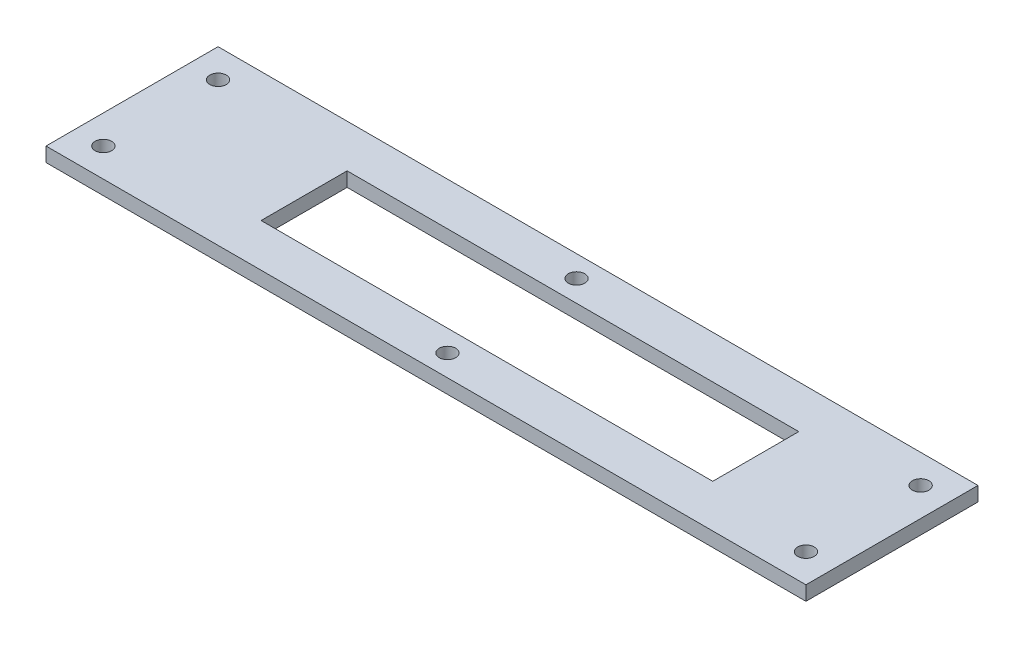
ISO-10303-21;
HEADER;
FILE_DESCRIPTION(('STEP AP214'),'2;1');
FILE_NAME('part.step','',(''),(''),'','','');
FILE_SCHEMA(('AUTOMOTIVE_DESIGN { 1 0 10303 214 1 1 1 1 }'));
ENDSEC;
DATA;
#1=APPLICATION_CONTEXT('core data for automotive mechanical design processes');
#2=APPLICATION_PROTOCOL_DEFINITION('international standard','automotive_design',2000,#1);
#3=PRODUCT_CONTEXT('',#1,'mechanical');
#4=PRODUCT('Part','Part','',(#3));
#5=PRODUCT_RELATED_PRODUCT_CATEGORY('part','',(#4));
#6=PRODUCT_DEFINITION_FORMATION('','',#4);
#7=PRODUCT_DEFINITION_CONTEXT('part definition',#1,'design');
#8=PRODUCT_DEFINITION('design','',#6,#7);
#9=PRODUCT_DEFINITION_SHAPE('','',#8);
#10=(LENGTH_UNIT() NAMED_UNIT(*) SI_UNIT(.MILLI.,.METRE.));
#11=(NAMED_UNIT(*) PLANE_ANGLE_UNIT() SI_UNIT($,.RADIAN.));
#12=(NAMED_UNIT(*) SI_UNIT($,.STERADIAN.) SOLID_ANGLE_UNIT());
#13=UNCERTAINTY_MEASURE_WITH_UNIT(LENGTH_MEASURE(1.E-05),#10,'distance_accuracy_value','');
#14=(GEOMETRIC_REPRESENTATION_CONTEXT(3) GLOBAL_UNCERTAINTY_ASSIGNED_CONTEXT((#13)) GLOBAL_UNIT_ASSIGNED_CONTEXT((#10,
#11,#12)) REPRESENTATION_CONTEXT('',''));
#15=CARTESIAN_POINT('',(0.,0.,0.));
#16=DIRECTION('',(0.,0.,1.));
#17=DIRECTION('',(1.,0.,0.));
#18=AXIS2_PLACEMENT_3D('',#15,#16,#17);
#19=CARTESIAN_POINT('',(0.,2.,0.));
#20=DIRECTION('',(0.,1.,0.));
#21=DIRECTION('',(0.,0.,1.));
#22=AXIS2_PLACEMENT_3D('',#19,#20,#21);
#23=PLANE('',#22);
#24=CARTESIAN_POINT('',(-0.5,2.,9.00000000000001));
#25=DIRECTION('',(0.,1.,0.));
#26=DIRECTION('',(0.,0.,1.));
#27=AXIS2_PLACEMENT_3D('',#24,#25,#26);
#28=CIRCLE('',#27,1.15);
#29=CARTESIAN_POINT('',(-0.5,2.,10.15));
#30=VERTEX_POINT('',#29);
#31=EDGE_CURVE('E254',#30,#30,#28,.T.);
#32=ORIENTED_EDGE('',*,*,#31,.F.);
#33=EDGE_LOOP('',(#32));
#34=FACE_BOUND('',#33,.T.);
#35=CARTESIAN_POINT('',(48.5,2.,8.));
#36=DIRECTION('',(0.,1.,0.));
#37=DIRECTION('',(0.,0.,1.));
#38=AXIS2_PLACEMENT_3D('',#35,#36,#37);
#39=CIRCLE('',#38,1.15);
#40=CARTESIAN_POINT('',(48.5,2.,9.15));
#41=VERTEX_POINT('',#40);
#42=EDGE_CURVE('E266',#41,#41,#39,.T.);
#43=ORIENTED_EDGE('',*,*,#42,.F.);
#44=EDGE_LOOP('',(#43));
#45=FACE_BOUND('',#44,.T.);
#46=CARTESIAN_POINT('',(-49.5,2.,-7.99999999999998));
#47=DIRECTION('',(0.,1.,0.));
#48=DIRECTION('',(0.,0.,1.));
#49=AXIS2_PLACEMENT_3D('',#46,#47,#48);
#50=CIRCLE('',#49,1.15);
#51=CARTESIAN_POINT('',(-49.5,2.,-6.84999999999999));
#52=VERTEX_POINT('',#51);
#53=EDGE_CURVE('E127',#52,#52,#50,.T.);
#54=ORIENTED_EDGE('',*,*,#53,.F.);
#55=EDGE_LOOP('',(#54));
#56=FACE_BOUND('',#55,.T.);
#57=DIRECTION('',(-1.,0.,0.));
#58=VECTOR('',#57,1.);
#59=CARTESIAN_POINT('',(52.5,2.,-12.));
#60=LINE('',#59,#58);
#61=CARTESIAN_POINT('',(52.5,2.,-12.));
#62=VERTEX_POINT('',#61);
#63=CARTESIAN_POINT('',(-53.5,2.,-12.));
#64=VERTEX_POINT('',#63);
#65=EDGE_CURVE('E137',#62,#64,#60,.T.);
#66=ORIENTED_EDGE('',*,*,#65,.T.);
#67=DIRECTION('',(0.,0.,1.));
#68=VECTOR('',#67,1.);
#69=CARTESIAN_POINT('',(-53.5,2.,-12.));
#70=LINE('',#69,#68);
#71=CARTESIAN_POINT('',(-53.5,2.,12.));
#72=VERTEX_POINT('',#71);
#73=EDGE_CURVE('E140',#64,#72,#70,.T.);
#74=ORIENTED_EDGE('',*,*,#73,.T.);
#75=DIRECTION('',(1.,0.,0.));
#76=VECTOR('',#75,1.);
#77=CARTESIAN_POINT('',(52.5,2.,12.));
#78=LINE('',#77,#76);
#79=CARTESIAN_POINT('',(52.5,2.,12.));
#80=VERTEX_POINT('',#79);
#81=EDGE_CURVE('E143',#72,#80,#78,.T.);
#82=ORIENTED_EDGE('',*,*,#81,.T.);
#83=DIRECTION('',(0.,0.,-1.));
#84=VECTOR('',#83,1.);
#85=CARTESIAN_POINT('',(52.5,2.,12.));
#86=LINE('',#85,#84);
#87=EDGE_CURVE('E145',#80,#62,#86,.T.);
#88=ORIENTED_EDGE('',*,*,#87,.T.);
#89=EDGE_LOOP('',(#66,#74,#82,#88));
#90=FACE_BOUND('',#89,.T.);
#91=DIRECTION('',(1.,0.,0.));
#92=VECTOR('',#91,1.);
#93=CARTESIAN_POINT('',(-29.5,2.,6.));
#94=LINE('',#93,#92);
#95=CARTESIAN_POINT('',(-29.5,2.,6.));
#96=VERTEX_POINT('',#95);
#97=CARTESIAN_POINT('',(33.5,2.,6.));
#98=VERTEX_POINT('',#97);
#99=EDGE_CURVE('E106',#96,#98,#94,.T.);
#100=ORIENTED_EDGE('',*,*,#99,.F.);
#101=DIRECTION('',(0.,0.,1.));
#102=VECTOR('',#101,1.);
#103=CARTESIAN_POINT('',(-29.5,2.,-6.));
#104=LINE('',#103,#102);
#105=CARTESIAN_POINT('',(-29.5,2.,-6.));
#106=VERTEX_POINT('',#105);
#107=EDGE_CURVE('E98',#106,#96,#104,.T.);
#108=ORIENTED_EDGE('',*,*,#107,.F.);
#109=DIRECTION('',(-1.,0.,0.));
#110=VECTOR('',#109,1.);
#111=CARTESIAN_POINT('',(-29.5,2.,-6.));
#112=LINE('',#111,#110);
#113=CARTESIAN_POINT('',(33.5,2.,-6.));
#114=VERTEX_POINT('',#113);
#115=EDGE_CURVE('E121',#114,#106,#112,.T.);
#116=ORIENTED_EDGE('',*,*,#115,.F.);
#117=DIRECTION('',(0.,0.,-1.));
#118=VECTOR('',#117,1.);
#119=CARTESIAN_POINT('',(33.5,2.,-6.));
#120=LINE('',#119,#118);
#121=EDGE_CURVE('E119',#98,#114,#120,.T.);
#122=ORIENTED_EDGE('',*,*,#121,.F.);
#123=EDGE_LOOP('',(#100,#108,#116,#122));
#124=FACE_BOUND('',#123,.T.);
#125=CARTESIAN_POINT('',(-49.5,2.,8.00000000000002));
#126=DIRECTION('',(0.,1.,0.));
#127=DIRECTION('',(0.,0.,1.));
#128=AXIS2_PLACEMENT_3D('',#125,#126,#127);
#129=CIRCLE('',#128,1.15);
#130=CARTESIAN_POINT('',(-49.5,2.,9.15000000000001));
#131=VERTEX_POINT('',#130);
#132=EDGE_CURVE('E272',#131,#131,#129,.T.);
#133=ORIENTED_EDGE('',*,*,#132,.F.);
#134=EDGE_LOOP('',(#133));
#135=FACE_BOUND('',#134,.T.);
#136=CARTESIAN_POINT('',(48.5,2.,-8.));
#137=DIRECTION('',(0.,1.,0.));
#138=DIRECTION('',(0.,0.,1.));
#139=AXIS2_PLACEMENT_3D('',#136,#137,#138);
#140=CIRCLE('',#139,1.15);
#141=CARTESIAN_POINT('',(48.5,2.,-6.85));
#142=VERTEX_POINT('',#141);
#143=EDGE_CURVE('E260',#142,#142,#140,.T.);
#144=ORIENTED_EDGE('',*,*,#143,.F.);
#145=EDGE_LOOP('',(#144));
#146=FACE_BOUND('',#145,.T.);
#147=CARTESIAN_POINT('',(-0.5,2.,-8.99999999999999));
#148=DIRECTION('',(0.,1.,0.));
#149=DIRECTION('',(0.,0.,1.));
#150=AXIS2_PLACEMENT_3D('',#147,#148,#149);
#151=CIRCLE('',#150,1.15);
#152=CARTESIAN_POINT('',(-0.5,2.,-7.84999999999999));
#153=VERTEX_POINT('',#152);
#154=EDGE_CURVE('E245',#153,#153,#151,.T.);
#155=ORIENTED_EDGE('',*,*,#154,.F.);
#156=EDGE_LOOP('',(#155));
#157=FACE_BOUND('',#156,.T.);
#158=ADVANCED_FACE('F33',(#34,#45,#56,#90,#124,#135,#146,#157),#23,.T.);
#159=CARTESIAN_POINT('',(0.,0.,0.));
#160=DIRECTION('',(0.,1.,0.));
#161=DIRECTION('',(0.,0.,1.));
#162=AXIS2_PLACEMENT_3D('',#159,#160,#161);
#163=PLANE('',#162);
#164=CARTESIAN_POINT('',(-0.5,0.,9.00000000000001));
#165=DIRECTION('',(0.,1.,0.));
#166=DIRECTION('',(0.,0.,1.));
#167=AXIS2_PLACEMENT_3D('',#164,#165,#166);
#168=CIRCLE('',#167,1.15);
#169=CARTESIAN_POINT('',(-0.5,0.,10.15));
#170=VERTEX_POINT('',#169);
#171=EDGE_CURVE('E251',#170,#170,#168,.T.);
#172=ORIENTED_EDGE('',*,*,#171,.T.);
#173=EDGE_LOOP('',(#172));
#174=FACE_BOUND('',#173,.T.);
#175=CARTESIAN_POINT('',(48.5,0.,8.));
#176=DIRECTION('',(0.,1.,0.));
#177=DIRECTION('',(0.,0.,1.));
#178=AXIS2_PLACEMENT_3D('',#175,#176,#177);
#179=CIRCLE('',#178,1.15);
#180=CARTESIAN_POINT('',(48.5,0.,9.15));
#181=VERTEX_POINT('',#180);
#182=EDGE_CURVE('E263',#181,#181,#179,.T.);
#183=ORIENTED_EDGE('',*,*,#182,.T.);
#184=EDGE_LOOP('',(#183));
#185=FACE_BOUND('',#184,.T.);
#186=CARTESIAN_POINT('',(-49.5,0.,-7.99999999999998));
#187=DIRECTION('',(0.,1.,0.));
#188=DIRECTION('',(0.,0.,1.));
#189=AXIS2_PLACEMENT_3D('',#186,#187,#188);
#190=CIRCLE('',#189,1.15);
#191=CARTESIAN_POINT('',(-49.5,0.,-6.84999999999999));
#192=VERTEX_POINT('',#191);
#193=EDGE_CURVE('E275',#192,#192,#190,.T.);
#194=ORIENTED_EDGE('',*,*,#193,.T.);
#195=EDGE_LOOP('',(#194));
#196=FACE_BOUND('',#195,.T.);
#197=DIRECTION('',(-1.,0.,0.));
#198=VECTOR('',#197,1.);
#199=CARTESIAN_POINT('',(52.5,0.,-12.));
#200=LINE('',#199,#198);
#201=CARTESIAN_POINT('',(52.5,0.,-12.));
#202=VERTEX_POINT('',#201);
#203=CARTESIAN_POINT('',(-53.5,0.,-12.));
#204=VERTEX_POINT('',#203);
#205=EDGE_CURVE('E114',#202,#204,#200,.T.);
#206=ORIENTED_EDGE('',*,*,#205,.F.);
#207=DIRECTION('',(0.,0.,-1.));
#208=VECTOR('',#207,1.);
#209=CARTESIAN_POINT('',(52.5,0.,12.));
#210=LINE('',#209,#208);
#211=CARTESIAN_POINT('',(52.5,0.,12.));
#212=VERTEX_POINT('',#211);
#213=EDGE_CURVE('E141',#212,#202,#210,.T.);
#214=ORIENTED_EDGE('',*,*,#213,.F.);
#215=DIRECTION('',(1.,0.,0.));
#216=VECTOR('',#215,1.);
#217=CARTESIAN_POINT('',(52.5,0.,12.));
#218=LINE('',#217,#216);
#219=CARTESIAN_POINT('',(-53.5,0.,12.));
#220=VERTEX_POINT('',#219);
#221=EDGE_CURVE('E152',#220,#212,#218,.T.);
#222=ORIENTED_EDGE('',*,*,#221,.F.);
#223=DIRECTION('',(0.,0.,1.));
#224=VECTOR('',#223,1.);
#225=CARTESIAN_POINT('',(-53.5,0.,-12.));
#226=LINE('',#225,#224);
#227=EDGE_CURVE('E150',#204,#220,#226,.T.);
#228=ORIENTED_EDGE('',*,*,#227,.F.);
#229=EDGE_LOOP('',(#206,#214,#222,#228));
#230=FACE_BOUND('',#229,.T.);
#231=DIRECTION('',(0.,0.,1.));
#232=VECTOR('',#231,1.);
#233=CARTESIAN_POINT('',(-29.5,0.,-6.));
#234=LINE('',#233,#232);
#235=CARTESIAN_POINT('',(-29.5,0.,-6.));
#236=VERTEX_POINT('',#235);
#237=CARTESIAN_POINT('',(-29.5,0.,6.));
#238=VERTEX_POINT('',#237);
#239=EDGE_CURVE('E56',#236,#238,#234,.T.);
#240=ORIENTED_EDGE('',*,*,#239,.T.);
#241=DIRECTION('',(1.,0.,0.));
#242=VECTOR('',#241,1.);
#243=CARTESIAN_POINT('',(-29.5,0.,6.));
#244=LINE('',#243,#242);
#245=CARTESIAN_POINT('',(33.5,0.,6.));
#246=VERTEX_POINT('',#245);
#247=EDGE_CURVE('E113',#238,#246,#244,.T.);
#248=ORIENTED_EDGE('',*,*,#247,.T.);
#249=DIRECTION('',(0.,0.,-1.));
#250=VECTOR('',#249,1.);
#251=CARTESIAN_POINT('',(33.5,0.,-6.));
#252=LINE('',#251,#250);
#253=CARTESIAN_POINT('',(33.5,0.,-6.));
#254=VERTEX_POINT('',#253);
#255=EDGE_CURVE('E129',#246,#254,#252,.T.);
#256=ORIENTED_EDGE('',*,*,#255,.T.);
#257=DIRECTION('',(-1.,0.,0.));
#258=VECTOR('',#257,1.);
#259=CARTESIAN_POINT('',(-29.5,0.,-6.));
#260=LINE('',#259,#258);
#261=EDGE_CURVE('E107',#254,#236,#260,.T.);
#262=ORIENTED_EDGE('',*,*,#261,.T.);
#263=EDGE_LOOP('',(#240,#248,#256,#262));
#264=FACE_BOUND('',#263,.T.);
#265=CARTESIAN_POINT('',(-49.5,0.,8.00000000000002));
#266=DIRECTION('',(0.,1.,0.));
#267=DIRECTION('',(0.,0.,1.));
#268=AXIS2_PLACEMENT_3D('',#265,#266,#267);
#269=CIRCLE('',#268,1.15);
#270=CARTESIAN_POINT('',(-49.5,0.,9.15000000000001));
#271=VERTEX_POINT('',#270);
#272=EDGE_CURVE('E269',#271,#271,#269,.T.);
#273=ORIENTED_EDGE('',*,*,#272,.T.);
#274=EDGE_LOOP('',(#273));
#275=FACE_BOUND('',#274,.T.);
#276=CARTESIAN_POINT('',(48.5,0.,-8.));
#277=DIRECTION('',(0.,1.,0.));
#278=DIRECTION('',(0.,0.,1.));
#279=AXIS2_PLACEMENT_3D('',#276,#277,#278);
#280=CIRCLE('',#279,1.15);
#281=CARTESIAN_POINT('',(48.5,0.,-6.85));
#282=VERTEX_POINT('',#281);
#283=EDGE_CURVE('E257',#282,#282,#280,.T.);
#284=ORIENTED_EDGE('',*,*,#283,.T.);
#285=EDGE_LOOP('',(#284));
#286=FACE_BOUND('',#285,.T.);
#287=CARTESIAN_POINT('',(-0.5,0.,-8.99999999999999));
#288=DIRECTION('',(0.,1.,0.));
#289=DIRECTION('',(0.,0.,1.));
#290=AXIS2_PLACEMENT_3D('',#287,#288,#289);
#291=CIRCLE('',#290,1.15);
#292=CARTESIAN_POINT('',(-0.5,0.,-7.84999999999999));
#293=VERTEX_POINT('',#292);
#294=EDGE_CURVE('E248',#293,#293,#291,.T.);
#295=ORIENTED_EDGE('',*,*,#294,.T.);
#296=EDGE_LOOP('',(#295));
#297=FACE_BOUND('',#296,.T.);
#298=ADVANCED_FACE('F170',(#174,#185,#196,#230,#264,#275,#286,#297),#163,.F.);
#299=CARTESIAN_POINT('',(52.5,2.,-12.));
#300=DIRECTION('',(0.,0.,1.));
#301=DIRECTION('',(1.,0.,0.));
#302=AXIS2_PLACEMENT_3D('',#299,#300,#301);
#303=PLANE('',#302);
#304=ORIENTED_EDGE('',*,*,#205,.T.);
#305=DIRECTION('',(0.,-1.,0.));
#306=VECTOR('',#305,1.);
#307=CARTESIAN_POINT('',(-53.5,2.,-12.));
#308=LINE('',#307,#306);
#309=EDGE_CURVE('E11',#64,#204,#308,.T.);
#310=ORIENTED_EDGE('',*,*,#309,.F.);
#311=ORIENTED_EDGE('',*,*,#65,.F.);
#312=DIRECTION('',(0.,-1.,0.));
#313=VECTOR('',#312,1.);
#314=CARTESIAN_POINT('',(52.5,2.,-12.));
#315=LINE('',#314,#313);
#316=EDGE_CURVE('E147',#62,#202,#315,.T.);
#317=ORIENTED_EDGE('',*,*,#316,.T.);
#318=EDGE_LOOP('',(#304,#310,#311,#317));
#319=FACE_BOUND('',#318,.T.);
#320=ADVANCED_FACE('F35',(#319),#303,.F.);
#321=CARTESIAN_POINT('',(-53.5,2.,-12.));
#322=DIRECTION('',(1.,0.,0.));
#323=DIRECTION('',(0.,0.,-1.));
#324=AXIS2_PLACEMENT_3D('',#321,#322,#323);
#325=PLANE('',#324);
#326=ORIENTED_EDGE('',*,*,#227,.T.);
#327=DIRECTION('',(0.,-1.,0.));
#328=VECTOR('',#327,1.);
#329=CARTESIAN_POINT('',(-53.5,2.,12.));
#330=LINE('',#329,#328);
#331=EDGE_CURVE('E41',#72,#220,#330,.T.);
#332=ORIENTED_EDGE('',*,*,#331,.F.);
#333=ORIENTED_EDGE('',*,*,#73,.F.);
#334=ORIENTED_EDGE('',*,*,#309,.T.);
#335=EDGE_LOOP('',(#326,#332,#333,#334));
#336=FACE_BOUND('',#335,.T.);
#337=ADVANCED_FACE('F180',(#336),#325,.F.);
#338=CARTESIAN_POINT('',(52.5,2.,12.));
#339=DIRECTION('',(0.,0.,-1.));
#340=DIRECTION('',(-1.,0.,0.));
#341=AXIS2_PLACEMENT_3D('',#338,#339,#340);
#342=PLANE('',#341);
#343=ORIENTED_EDGE('',*,*,#221,.T.);
#344=DIRECTION('',(0.,-1.,0.));
#345=VECTOR('',#344,1.);
#346=CARTESIAN_POINT('',(52.5,2.,12.));
#347=LINE('',#346,#345);
#348=EDGE_CURVE('E157',#80,#212,#347,.T.);
#349=ORIENTED_EDGE('',*,*,#348,.F.);
#350=ORIENTED_EDGE('',*,*,#81,.F.);
#351=ORIENTED_EDGE('',*,*,#331,.T.);
#352=EDGE_LOOP('',(#343,#349,#350,#351));
#353=FACE_BOUND('',#352,.T.);
#354=ADVANCED_FACE('F164',(#353),#342,.F.);
#355=CARTESIAN_POINT('',(52.5,2.,12.));
#356=DIRECTION('',(-1.,0.,0.));
#357=DIRECTION('',(0.,0.,1.));
#358=AXIS2_PLACEMENT_3D('',#355,#356,#357);
#359=PLANE('',#358);
#360=ORIENTED_EDGE('',*,*,#213,.T.);
#361=ORIENTED_EDGE('',*,*,#316,.F.);
#362=ORIENTED_EDGE('',*,*,#87,.F.);
#363=ORIENTED_EDGE('',*,*,#348,.T.);
#364=EDGE_LOOP('',(#360,#361,#362,#363));
#365=FACE_BOUND('',#364,.T.);
#366=ADVANCED_FACE('F174',(#365),#359,.F.);
#367=CARTESIAN_POINT('',(-29.5,2.,-6.));
#368=DIRECTION('',(1.,0.,0.));
#369=DIRECTION('',(0.,0.,-1.));
#370=AXIS2_PLACEMENT_3D('',#367,#368,#369);
#371=PLANE('',#370);
#372=ORIENTED_EDGE('',*,*,#239,.F.);
#373=DIRECTION('',(0.,-1.,0.));
#374=VECTOR('',#373,1.);
#375=CARTESIAN_POINT('',(-29.5,2.,-6.));
#376=LINE('',#375,#374);
#377=EDGE_CURVE('E102',#106,#236,#376,.T.);
#378=ORIENTED_EDGE('',*,*,#377,.F.);
#379=ORIENTED_EDGE('',*,*,#107,.T.);
#380=DIRECTION('',(0.,-1.,0.));
#381=VECTOR('',#380,1.);
#382=CARTESIAN_POINT('',(-29.5,2.,6.));
#383=LINE('',#382,#381);
#384=EDGE_CURVE('E101',#96,#238,#383,.T.);
#385=ORIENTED_EDGE('',*,*,#384,.T.);
#386=EDGE_LOOP('',(#372,#378,#379,#385));
#387=FACE_BOUND('',#386,.T.);
#388=ADVANCED_FACE('F100',(#387),#371,.T.);
#389=CARTESIAN_POINT('',(-29.5,2.,6.));
#390=DIRECTION('',(0.,0.,-1.));
#391=DIRECTION('',(-1.,0.,0.));
#392=AXIS2_PLACEMENT_3D('',#389,#390,#391);
#393=PLANE('',#392);
#394=ORIENTED_EDGE('',*,*,#247,.F.);
#395=ORIENTED_EDGE('',*,*,#384,.F.);
#396=ORIENTED_EDGE('',*,*,#99,.T.);
#397=DIRECTION('',(0.,-1.,0.));
#398=VECTOR('',#397,1.);
#399=CARTESIAN_POINT('',(33.5,2.,6.));
#400=LINE('',#399,#398);
#401=EDGE_CURVE('E115',#98,#246,#400,.T.);
#402=ORIENTED_EDGE('',*,*,#401,.T.);
#403=EDGE_LOOP('',(#394,#395,#396,#402));
#404=FACE_BOUND('',#403,.T.);
#405=ADVANCED_FACE('F110',(#404),#393,.T.);
#406=CARTESIAN_POINT('',(33.5,2.,-6.));
#407=DIRECTION('',(-1.,0.,0.));
#408=DIRECTION('',(0.,0.,1.));
#409=AXIS2_PLACEMENT_3D('',#406,#407,#408);
#410=PLANE('',#409);
#411=ORIENTED_EDGE('',*,*,#255,.F.);
#412=ORIENTED_EDGE('',*,*,#401,.F.);
#413=ORIENTED_EDGE('',*,*,#121,.T.);
#414=DIRECTION('',(0.,-1.,0.));
#415=VECTOR('',#414,1.);
#416=CARTESIAN_POINT('',(33.5,2.,-6.));
#417=LINE('',#416,#415);
#418=EDGE_CURVE('E48',#114,#254,#417,.T.);
#419=ORIENTED_EDGE('',*,*,#418,.T.);
#420=EDGE_LOOP('',(#411,#412,#413,#419));
#421=FACE_BOUND('',#420,.T.);
#422=ADVANCED_FACE('F207',(#421),#410,.T.);
#423=CARTESIAN_POINT('',(-29.5,2.,-6.));
#424=DIRECTION('',(0.,0.,1.));
#425=DIRECTION('',(1.,0.,0.));
#426=AXIS2_PLACEMENT_3D('',#423,#424,#425);
#427=PLANE('',#426);
#428=ORIENTED_EDGE('',*,*,#261,.F.);
#429=ORIENTED_EDGE('',*,*,#418,.F.);
#430=ORIENTED_EDGE('',*,*,#115,.T.);
#431=ORIENTED_EDGE('',*,*,#377,.T.);
#432=EDGE_LOOP('',(#428,#429,#430,#431));
#433=FACE_BOUND('',#432,.T.);
#434=ADVANCED_FACE('F211',(#433),#427,.T.);
#435=CARTESIAN_POINT('',(-49.5,2.,-7.99999999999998));
#436=DIRECTION('',(0.,-1.,0.));
#437=DIRECTION('',(0.,0.,-1.));
#438=AXIS2_PLACEMENT_3D('',#435,#436,#437);
#439=CYLINDRICAL_SURFACE('',#438,1.15);
#440=ORIENTED_EDGE('',*,*,#53,.T.);
#441=EDGE_LOOP('',(#440));
#442=FACE_BOUND('',#441,.T.);
#443=ORIENTED_EDGE('',*,*,#193,.F.);
#444=EDGE_LOOP('',(#443));
#445=FACE_BOUND('',#444,.T.);
#446=ADVANCED_FACE('F217',(#442,#445),#439,.F.);
#447=CARTESIAN_POINT('',(-49.5,2.,8.00000000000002));
#448=DIRECTION('',(0.,-1.,0.));
#449=DIRECTION('',(0.,0.,-1.));
#450=AXIS2_PLACEMENT_3D('',#447,#448,#449);
#451=CYLINDRICAL_SURFACE('',#450,1.15);
#452=ORIENTED_EDGE('',*,*,#132,.T.);
#453=EDGE_LOOP('',(#452));
#454=FACE_BOUND('',#453,.T.);
#455=ORIENTED_EDGE('',*,*,#272,.F.);
#456=EDGE_LOOP('',(#455));
#457=FACE_BOUND('',#456,.T.);
#458=ADVANCED_FACE('F220',(#454,#457),#451,.F.);
#459=CARTESIAN_POINT('',(48.5,2.,8.));
#460=DIRECTION('',(0.,-1.,0.));
#461=DIRECTION('',(0.,0.,-1.));
#462=AXIS2_PLACEMENT_3D('',#459,#460,#461);
#463=CYLINDRICAL_SURFACE('',#462,1.15);
#464=ORIENTED_EDGE('',*,*,#42,.T.);
#465=EDGE_LOOP('',(#464));
#466=FACE_BOUND('',#465,.T.);
#467=ORIENTED_EDGE('',*,*,#182,.F.);
#468=EDGE_LOOP('',(#467));
#469=FACE_BOUND('',#468,.T.);
#470=ADVANCED_FACE('F224',(#466,#469),#463,.F.);
#471=CARTESIAN_POINT('',(48.5,2.,-8.));
#472=DIRECTION('',(0.,-1.,0.));
#473=DIRECTION('',(0.,0.,-1.));
#474=AXIS2_PLACEMENT_3D('',#471,#472,#473);
#475=CYLINDRICAL_SURFACE('',#474,1.15);
#476=ORIENTED_EDGE('',*,*,#143,.T.);
#477=EDGE_LOOP('',(#476));
#478=FACE_BOUND('',#477,.T.);
#479=ORIENTED_EDGE('',*,*,#283,.F.);
#480=EDGE_LOOP('',(#479));
#481=FACE_BOUND('',#480,.T.);
#482=ADVANCED_FACE('F228',(#478,#481),#475,.F.);
#483=CARTESIAN_POINT('',(-0.5,2.,9.00000000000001));
#484=DIRECTION('',(0.,-1.,0.));
#485=DIRECTION('',(0.,0.,-1.));
#486=AXIS2_PLACEMENT_3D('',#483,#484,#485);
#487=CYLINDRICAL_SURFACE('',#486,1.15);
#488=ORIENTED_EDGE('',*,*,#31,.T.);
#489=EDGE_LOOP('',(#488));
#490=FACE_BOUND('',#489,.T.);
#491=ORIENTED_EDGE('',*,*,#171,.F.);
#492=EDGE_LOOP('',(#491));
#493=FACE_BOUND('',#492,.T.);
#494=ADVANCED_FACE('F232',(#490,#493),#487,.F.);
#495=CARTESIAN_POINT('',(-0.5,2.,-8.99999999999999));
#496=DIRECTION('',(0.,-1.,0.));
#497=DIRECTION('',(0.,0.,-1.));
#498=AXIS2_PLACEMENT_3D('',#495,#496,#497);
#499=CYLINDRICAL_SURFACE('',#498,1.15);
#500=ORIENTED_EDGE('',*,*,#154,.T.);
#501=EDGE_LOOP('',(#500));
#502=FACE_BOUND('',#501,.T.);
#503=ORIENTED_EDGE('',*,*,#294,.F.);
#504=EDGE_LOOP('',(#503));
#505=FACE_BOUND('',#504,.T.);
#506=ADVANCED_FACE('F236',(#502,#505),#499,.F.);
#507=CLOSED_SHELL('',(#158,#298,#320,#337,#354,#366,#388,#405,#422,#434,#446,#458,#470,#482,
#494,#506));
#508=MANIFOLD_SOLID_BREP('B2',#507);
#509=ADVANCED_BREP_SHAPE_REPRESENTATION('',(#18,#508),#14);
#510=SHAPE_DEFINITION_REPRESENTATION(#9,#509);
ENDSEC;
END-ISO-10303-21;
